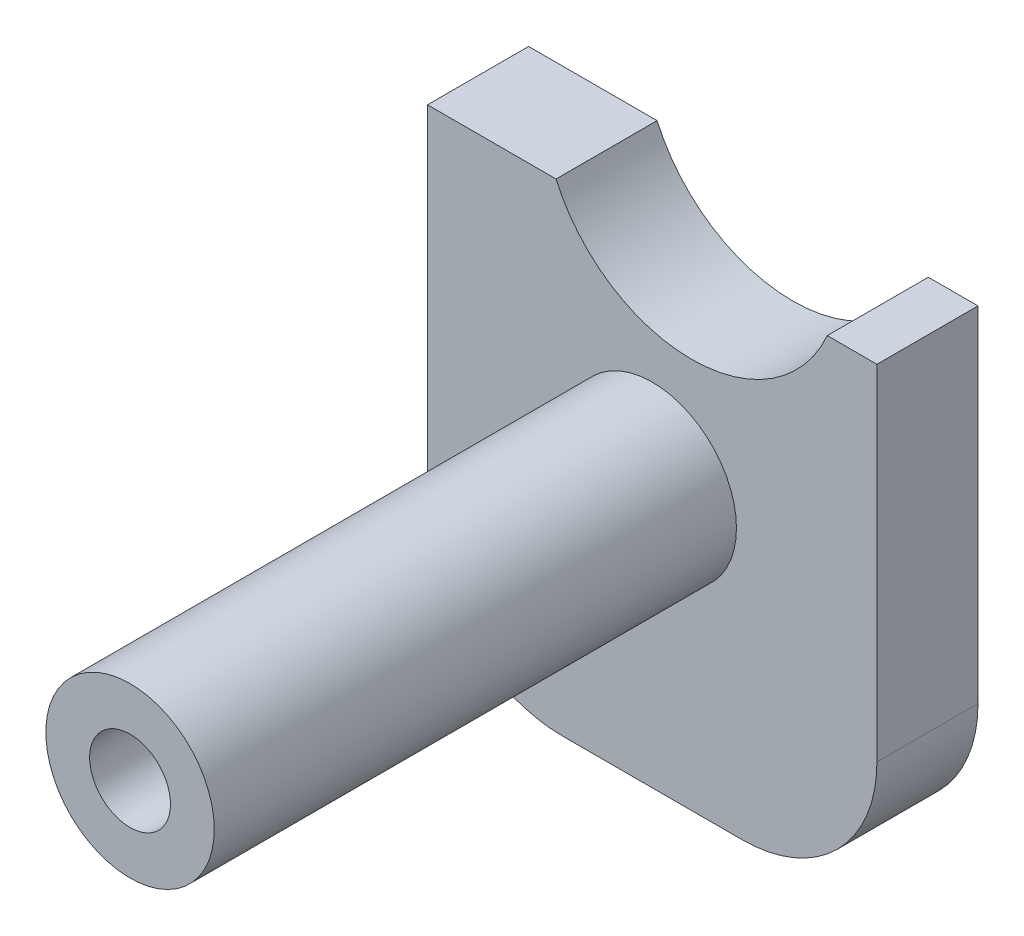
from build123d import *

# Parameters (mm, degrees)
ESQUISSE1_R      = 1.2
EXTRUSION1_DEPTH = 3
ESQUISSE2_R      = 2.5
ESQUISSE2_R_2    = 1.2
EXTRUSION2_DEPTH = 15.5


with BuildPart() as part:
    # Esquisse1 → Extrusion1 (new body)
    with BuildSketch(Plane.XY):
        with BuildLine():
            Line((21.16, -20.592093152), (26.5, -20.592093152))
            ThreePointArc((26.5, -20.592093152), (29.328427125, -19.420520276), (30.5, -16.592093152))
            Line((30.5, -16.592093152), (30.5, -6.368159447))
            Line((30.5, -6.368159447), (29.025616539, -6.368159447))
            ThreePointArc((29.025616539, -6.368159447), (25, -8.992093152), (20.974383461, -6.368159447))
            Line((20.974383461, -6.368159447), (17.16, -6.368159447))
            Line((17.16, -6.368159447), (17.16, -16.592093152))
            ThreePointArc((17.16, -16.592093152), (18.331572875, -19.420520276), (21.16, -20.592093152))
        make_face()
        with Locations((23.83, -12.662093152)):
            Circle(ESQUISSE1_R, mode=Mode.SUBTRACT)
    extrude(amount=EXTRUSION1_DEPTH)

    # Esquisse2 → Extrusion2 (add)
    with BuildSketch(Plane.XY.offset(3)):
        with Locations((23.83, -12.662093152)):
            Circle(ESQUISSE2_R)
        with Locations((23.83, -12.662093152)):
            Circle(ESQUISSE2_R_2, mode=Mode.SUBTRACT)
    extrude(amount=EXTRUSION2_DEPTH)


solid = part.part
